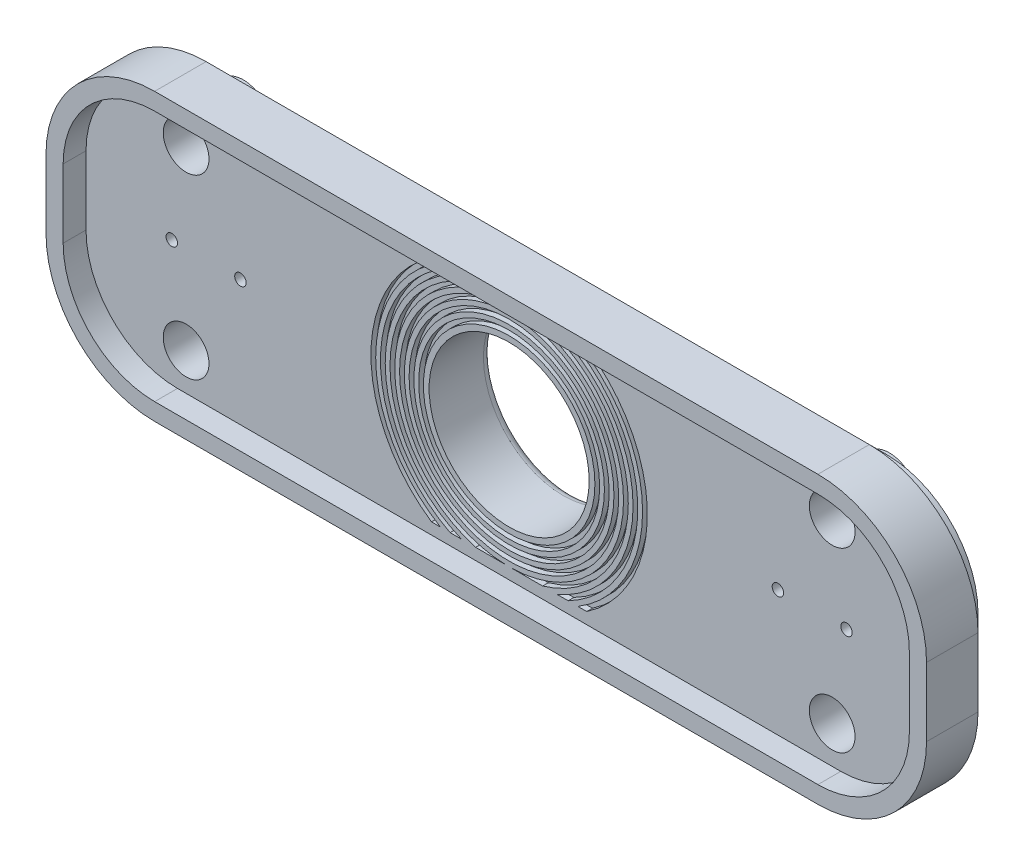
from build123d import *

# Parameters (mm, degrees)
BOSS_EXTRUDE1_DEPTH      = 1
BOSS_EXTRUDE2_DEPTH      = 3
BOSS_EXTRUDE2_DEPTH_BACK = 1.5
BOSS_EXTRUDE3_START      = 2
BOSS_EXTRUDE3_DEPTH      = 2
SKETCH3_R                = 7
SKETCH3_R_2              = 2
SKETCH3_R_3              = 0.5
CUT_EXTRUDE1_DEPTH       = 41.675545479
SKETCH4_R                = 8.5
SKETCH4_R_2              = 7
BOSS_EXTRUDE4_DEPTH      = 3.5
SKETCH5_R                = 4.25
SKETCH5_R_2              = 3.1
BOSS_EXTRUDE5_DEPTH      = 3.9
SKETCH6_R                = 2.5
SKETCH6_R_2              = 1.6
BOSS_EXTRUDE6_DEPTH      = 4.5
SKETCH7_R                = 2.5
SKETCH7_R_2              = 2
BOSS_EXTRUDE7_DEPTH      = 3
FILLET1_R                = 0.75
CHAMFER1_SIZE            = 0.75
CHAMFER2_SIZE            = 0.6
SKETCH8_R                = 9.583333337
SKETCH8_R_2              = 9.16666667
SKETCH8_R_3              = 8.750000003
SKETCH8_R_4              = 8.333333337
SKETCH8_R_5              = 7.91666667
SKETCH8_R_6              = 7.5
CUT_EXTRUDE6_DEPTH       = 0.5


with BuildPart() as part:
    # Sketch1 → Boss-Extrude1 (new, symmetric)
    with BuildSketch(Plane.XY):
        with BuildLine():
            Line((-29, 11), (29, 11))
            ThreePointArc((29, 11), (34.656854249, 8.656854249), (37, 3))
            Line((37, 3), (37, -3))
            ThreePointArc((37, -3), (34.656854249, -8.656854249), (29, -11))
            Line((29, -11), (-29, -11))
            ThreePointArc((-29, -11), (-34.656854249, -8.656854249), (-37, -3))
            Line((-37, -3), (-37, 3))
            ThreePointArc((-37, 3), (-34.656854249, 8.656854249), (-29, 11))
        make_face()
    extrude(amount=BOSS_EXTRUDE1_DEPTH, both=True)

    # Sketch1_4 → Boss-Extrude2 (add, two sides: drawn at the far end of the back side and taken through both)
    with BuildSketch(Plane.XY.offset(-BOSS_EXTRUDE2_DEPTH_BACK)):
        with BuildLine():
            Line((-29, 12.5), (29, 12.5))
            ThreePointArc((29, 12.5), (35.717514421, 9.717514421), (38.5, 3))
            Line((38.5, 3), (38.5, -3))
            ThreePointArc((38.5, -3), (35.717514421, -9.717514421), (29, -12.5))
            Line((29, -12.5), (-29, -12.5))
            ThreePointArc((-29, -12.5), (-35.717514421, -9.717514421), (-38.5, -3))
            Line((-38.5, -3), (-38.5, 3))
            ThreePointArc((-38.5, 3), (-35.717514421, 9.717514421), (-29, 12.5))
        make_face()
        with BuildLine():
            Line((-29, 11), (29, 11))
            ThreePointArc((29, 11), (34.656854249, 8.656854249), (37, 3))
            Line((37, 3), (37, -3))
            ThreePointArc((37, -3), (34.656854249, -8.656854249), (29, -11))
            Line((29, -11), (-29, -11))
            ThreePointArc((-29, -11), (-34.656854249, -8.656854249), (-37, -3))
            Line((-37, -3), (-37, 3))
            ThreePointArc((-37, 3), (-34.656854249, 8.656854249), (-29, 11))
        make_face(mode=Mode.SUBTRACT)
    extrude(amount=BOSS_EXTRUDE2_DEPTH + BOSS_EXTRUDE2_DEPTH_BACK)

    # Sketch2 → Boss-Extrude3 (add)
    with BuildSketch(Plane(origin=(0, 0, -1), x_dir=(-1, 0, 0), z_dir=(0, 0, -1)).offset(BOSS_EXTRUDE3_START)):
        with BuildLine():
            Line((29, 11), (-29, 11))
            ThreePointArc((-29, 11), (-34.656854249, 8.656854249), (-37, 3))
            Line((-37, 3), (-37, -3))
            ThreePointArc((-37, -3), (-34.656854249, -8.656854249), (-29, -11))
            Line((-29, -11), (29, -11))
            ThreePointArc((29, -11), (34.656854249, -8.656854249), (37, -3))
            Line((37, -3), (37, 3))
            ThreePointArc((37, 3), (34.656854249, 8.656854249), (29, 11))
        make_face()
        with BuildLine():
            Line((29, 10), (-29, 10))
            ThreePointArc((-29, 10), (-33.949747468, 7.949747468), (-36, 3))
            Line((-36, 3), (-36, -3))
            ThreePointArc((-36, -3), (-33.949747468, -7.949747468), (-29, -10))
            Line((-29, -10), (29, -10))
            ThreePointArc((29, -10), (33.949747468, -7.949747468), (36, -3))
            Line((36, -3), (36, 3))
            ThreePointArc((36, 3), (33.949747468, 7.949747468), (29, 10))
        make_face(mode=Mode.SUBTRACT)
    extrude(amount=-BOSS_EXTRUDE3_DEPTH)

    # Sketch3 → Cut-Extrude1 (cut, through all)
    with BuildSketch(Plane.XY.offset(1)):
        Circle(SKETCH3_R)
        with Locations((-28.25, 7.75)):
            Circle(SKETCH3_R_2)
        with Locations((28.25, 7.75)):
            Circle(SKETCH3_R_2)
        with Locations((28.25, -7.75)):
            Circle(SKETCH3_R_2)
        with Locations((-28.25, -7.75)):
            Circle(SKETCH3_R_2)
        with Locations((-29.5, 0)):
            Circle(SKETCH3_R_3)
        with Locations((29.5, 0)):
            Circle(SKETCH3_R_3)
        with Locations((23.5, 0)):
            Circle(SKETCH3_R_3)
        with Locations((-23.5, 0)):
            Circle(SKETCH3_R_3)
    extrude(amount=-CUT_EXTRUDE1_DEPTH, mode=Mode.SUBTRACT)

    # Sketch4 → Boss-Extrude4 (add)
    with BuildSketch(Plane(origin=(0, 0, -1), x_dir=(-1, 0, 0), z_dir=(0, 0, -1))):
        with Locations(Location((0, 0, 0), (0, 0, 180))):
            Circle(SKETCH4_R)
        with Locations(Location((0, 0, 0), (0, 0, 180))):
            Circle(SKETCH4_R_2, mode=Mode.SUBTRACT)
    extrude(amount=BOSS_EXTRUDE4_DEPTH)

    # Sketch5 → Boss-Extrude5 (add)
    # profile 1 of 2: a face of its own
    with BuildSketch(Plane(origin=(0, 0, -1), x_dir=(-1, 0, 0), z_dir=(0, 0, -1))):
        with Locations(Location((29.5, 0, 0), (0, 0, 180))):
            Circle(SKETCH5_R)
        with Locations((29.5, 0)):
            Circle(SKETCH5_R_2, mode=Mode.SUBTRACT)
    # profile 2 of 2: a face of its own
    with BuildSketch(Plane(origin=(0, 0, -1), x_dir=(-1, 0, 0), z_dir=(0, 0, -1))):
        with Locations(Location((-29.5, 0, 0), (0, 0, 180))):
            Circle(SKETCH5_R)
        with Locations((-29.5, 0)):
            Circle(SKETCH5_R_2, mode=Mode.SUBTRACT)
    extrude(amount=BOSS_EXTRUDE5_DEPTH)

    # Sketch6 → Boss-Extrude6 (add)
    # profile 1 of 2: a face of its own
    with BuildSketch(Plane(origin=(0, 0, -1), x_dir=(-1, 0, 0), z_dir=(0, 0, -1))):
        with Locations(Location((23.5, 0, 0), (0, 0, 323.731147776))):
            Circle(SKETCH6_R)
        with Locations((23.5, 0)):
            Circle(SKETCH6_R_2, mode=Mode.SUBTRACT)
    # profile 2 of 2: a face of its own
    with BuildSketch(Plane(origin=(0, 0, -1), x_dir=(-1, 0, 0), z_dir=(0, 0, -1))):
        with Locations(Location((-23.5, 0, 0), (0, 0, 216.268852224))):
            Circle(SKETCH6_R)
        with Locations((-23.5, 0)):
            Circle(SKETCH6_R_2, mode=Mode.SUBTRACT)
    extrude(amount=BOSS_EXTRUDE6_DEPTH)

    # Sketch7 → Boss-Extrude7 (add)
    # profile 1 of 4: a face of its own
    with BuildSketch(Plane(origin=(0, 0, -1), x_dir=(-1, 0, 0), z_dir=(0, 0, -1))):
        with Locations(Location((-28.25, 7.75, 0), (0, 0, 116.320774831))):
            Circle(SKETCH7_R)
        with Locations(Location((-28.25, 7.75, 0), (0, 0, 180))):
            Circle(SKETCH7_R_2, mode=Mode.SUBTRACT)
    # profile 2 of 4: a face of its own
    with BuildSketch(Plane(origin=(0, 0, -1), x_dir=(-1, 0, 0), z_dir=(0, 0, -1))):
        with Locations(Location((-28.25, -7.75, 0), (0, 0, 243.679225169))):
            Circle(SKETCH7_R)
        with Locations(Location((-28.25, -7.75, 0), (0, 0, 180))):
            Circle(SKETCH7_R_2, mode=Mode.SUBTRACT)
    # profile 3 of 4: a face of its own
    with BuildSketch(Plane(origin=(0, 0, -1), x_dir=(-1, 0, 0), z_dir=(0, 0, -1))):
        with Locations(Location((28.25, 7.75, 0), (0, 0, 115.841932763))):
            Circle(SKETCH7_R)
        with Locations(Location((28.25, 7.75, 0), (0, 0, 180))):
            Circle(SKETCH7_R_2, mode=Mode.SUBTRACT)
    # profile 4 of 4: a face of its own
    with BuildSketch(Plane(origin=(0, 0, -1), x_dir=(-1, 0, 0), z_dir=(0, 0, -1))):
        with Locations(Location((28.25, -7.75, 0), (0, 0, 244.158067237))):
            Circle(SKETCH7_R)
        with Locations(Location((28.25, -7.75, 0), (0, 0, 180))):
            Circle(SKETCH7_R_2, mode=Mode.SUBTRACT)
    extrude(amount=BOSS_EXTRUDE7_DEPTH)

    # Fillet1
    fillet1_edges = [part.edges().sort_by_distance(p)[0] for p in [
        (-7, 0, -4.5),
    ]]
    fillet(fillet1_edges, radius=FILLET1_R)

    # Chamfer1
    chamfer1_edges = [part.edges().sort_by_distance(p)[0] for p in [
        (-24, 0, -1),
        (23, 0, -1),
        (29, 0, -1),
        (-30, 0, -1),
    ]]
    chamfer(chamfer1_edges, length=CHAMFER1_SIZE)

    # Chamfer2
    chamfer2_edges = [part.edges().sort_by_distance(p)[0] for p in [
        (-21.9, 0, -5.5),
        (25.1, 0, -5.5),
    ]]
    chamfer(chamfer2_edges, length=CHAMFER2_SIZE)

    # Sketch8 → Cut-Extrude6 (cut)
    # profile 1 of 9: a face of its own
    with BuildSketch(Plane.XY.offset(1)):
        Circle(SKETCH8_R)
        Circle(SKETCH8_R_2, mode=Mode.SUBTRACT)
    # profile 2 of 9: a face of its own
    with BuildSketch(Plane.XY.offset(1)):
        Circle(SKETCH8_R_3)
        Circle(SKETCH8_R_4, mode=Mode.SUBTRACT)
    # profile 3 of 9: a face of its own
    with BuildSketch(Plane.XY.offset(1)):
        Circle(SKETCH8_R_5)
        Circle(SKETCH8_R_6, mode=Mode.SUBTRACT)
    # profile 4 of 9: a face of its own
    with BuildSketch(Plane.XY.offset(1)):
        with BuildLine():
            Line((-0.258220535, 10), (-2.928549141, 10))
            ThreePointArc((-2.928549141, 10), (-10.420000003, 0), (-2.928549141, -10))
            Line((-2.928549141, -10), (-0.258220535, -10))
            ThreePointArc((-0.258220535, -10), (-10.003333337, 0), (-0.258220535, 10))
        make_face()
    # profile 5 of 9: a face of its own
    with BuildSketch(Plane.XY.offset(1)):
        with BuildLine():
            Line((-4.175325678, 10), (-5.161154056, 10))
            ThreePointArc((-5.161154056, 10), (-11.253333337, 0), (-5.161154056, -10))
            Line((-5.161154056, -10), (-4.175325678, -10))
            ThreePointArc((-4.175325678, -10), (-10.83666667, 0), (-4.175325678, 10))
        make_face()
    # profile 6 of 9: a face of its own
    with BuildSketch(Plane.XY.offset(1)):
        with BuildLine():
            Line((-6.015721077, 10), (-6.788778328, 10))
            ThreePointArc((-6.788778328, 10), (-12.08666667, 0), (-6.788778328, -10))
            Line((-6.788778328, -10), (-6.015721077, -10))
            ThreePointArc((-6.015721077, -10), (-11.670000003, 0), (-6.015721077, 10))
        make_face()
    # profile 7 of 9: a face of its own
    with BuildSketch(Plane.XY.offset(1)):
        with BuildLine():
            Line((2.928549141, 10), (0.258220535, 10))
            ThreePointArc((0.258220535, 10), (7.164137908, 6.981533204), (10.003333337, 0))
            ThreePointArc((10.003333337, 0), (7.164137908, -6.981533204), (0.258220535, -10))
            Line((0.258220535, -10), (2.928549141, -10))
            ThreePointArc((2.928549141, -10), (10.420000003, 0), (2.928549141, 10))
        make_face()
    # profile 8 of 9: a face of its own
    with BuildSketch(Plane.XY.offset(1)):
        with BuildLine():
            Line((5.161154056, 10), (4.175325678, 10))
            ThreePointArc((4.175325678, 10), (10.83666667, 0), (4.175325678, -10))
            Line((4.175325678, -10), (5.161154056, -10))
            ThreePointArc((5.161154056, -10), (11.253333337, 0), (5.161154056, 10))
        make_face()
    # profile 9 of 9: a face of its own
    with BuildSketch(Plane.XY.offset(1)):
        with BuildLine():
            Line((6.788778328, 10), (6.015721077, 10))
            ThreePointArc((6.015721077, 10), (11.670000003, 0), (6.015721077, -10))
            Line((6.015721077, -10), (6.788778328, -10))
            ThreePointArc((6.788778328, -10), (12.08666667, 0), (6.788778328, 10))
        make_face()
    extrude(amount=-CUT_EXTRUDE6_DEPTH, mode=Mode.SUBTRACT)


solid = part.part
